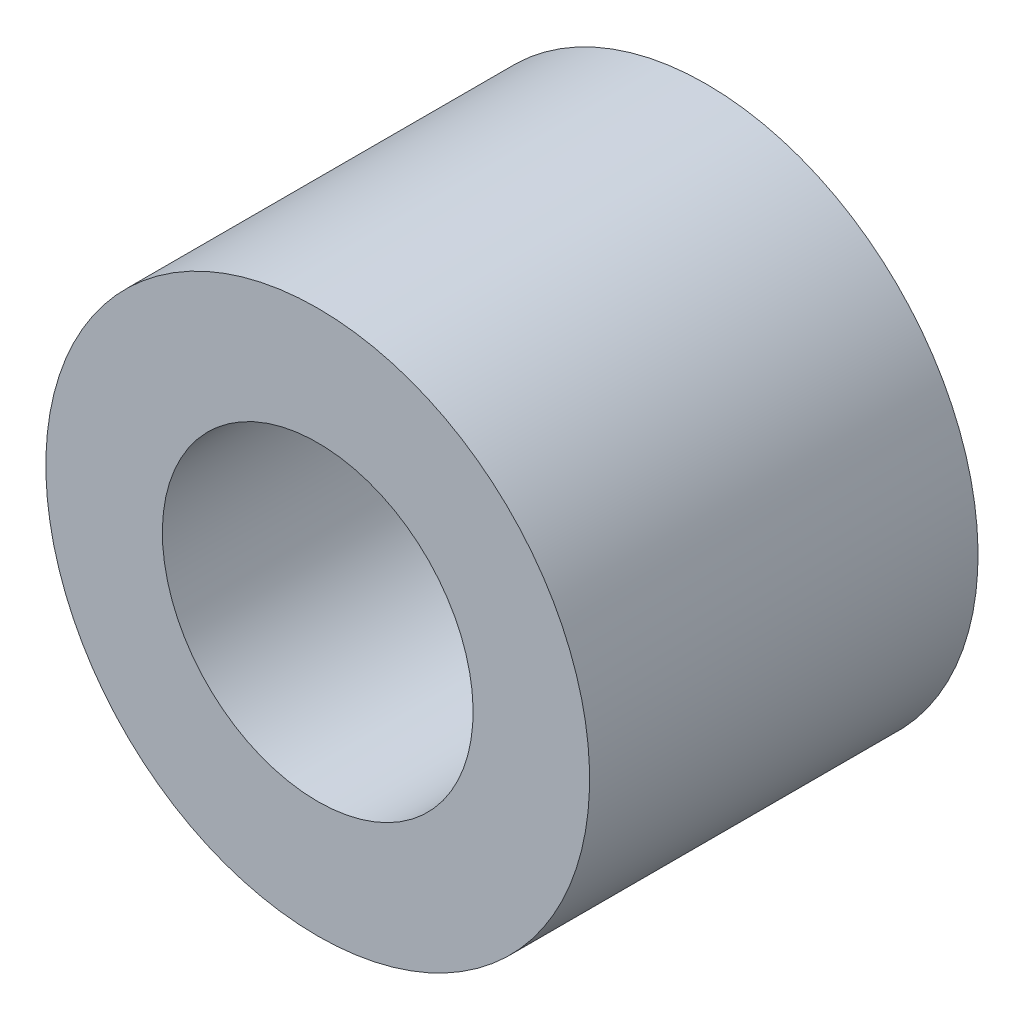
ISO-10303-21;
HEADER;
FILE_DESCRIPTION(('STEP AP214'),'2;1');
FILE_NAME('part.step','',(''),(''),'','','');
FILE_SCHEMA(('AUTOMOTIVE_DESIGN { 1 0 10303 214 1 1 1 1 }'));
ENDSEC;
DATA;
#1=APPLICATION_CONTEXT('core data for automotive mechanical design processes');
#2=APPLICATION_PROTOCOL_DEFINITION('international standard','automotive_design',2000,#1);
#3=PRODUCT_CONTEXT('',#1,'mechanical');
#4=PRODUCT('Part','Part','',(#3));
#5=PRODUCT_RELATED_PRODUCT_CATEGORY('part','',(#4));
#6=PRODUCT_DEFINITION_FORMATION('','',#4);
#7=PRODUCT_DEFINITION_CONTEXT('part definition',#1,'design');
#8=PRODUCT_DEFINITION('design','',#6,#7);
#9=PRODUCT_DEFINITION_SHAPE('','',#8);
#10=(LENGTH_UNIT() NAMED_UNIT(*) SI_UNIT(.MILLI.,.METRE.));
#11=(NAMED_UNIT(*) PLANE_ANGLE_UNIT() SI_UNIT($,.RADIAN.));
#12=(NAMED_UNIT(*) SI_UNIT($,.STERADIAN.) SOLID_ANGLE_UNIT());
#13=UNCERTAINTY_MEASURE_WITH_UNIT(LENGTH_MEASURE(1.E-05),#10,'distance_accuracy_value','');
#14=(GEOMETRIC_REPRESENTATION_CONTEXT(3) GLOBAL_UNCERTAINTY_ASSIGNED_CONTEXT((#13)) GLOBAL_UNIT_ASSIGNED_CONTEXT((#10,
#11,#12)) REPRESENTATION_CONTEXT('',''));
#15=CARTESIAN_POINT('',(0.,0.,0.));
#16=DIRECTION('',(0.,0.,1.));
#17=DIRECTION('',(1.,0.,0.));
#18=AXIS2_PLACEMENT_3D('',#15,#16,#17);
#19=CARTESIAN_POINT('',(17.5,0.,0.));
#20=DIRECTION('',(0.,0.,1.));
#21=DIRECTION('',(0.,-1.,0.));
#22=AXIS2_PLACEMENT_3D('',#19,#20,#21);
#23=PLANE('',#22);
#24=CARTESIAN_POINT('',(0.,0.,0.));
#25=DIRECTION('',(0.,0.,1.));
#26=DIRECTION('',(0.,-1.,0.));
#27=AXIS2_PLACEMENT_3D('',#24,#25,#26);
#28=CIRCLE('',#27,10.);
#29=CARTESIAN_POINT('',(0.,-10.,0.));
#30=VERTEX_POINT('',#29);
#31=EDGE_CURVE('E22',#30,#30,#28,.T.);
#32=ORIENTED_EDGE('',*,*,#31,.T.);
#33=EDGE_LOOP('',(#32));
#34=FACE_BOUND('',#33,.T.);
#35=CARTESIAN_POINT('',(0.,0.,0.));
#36=DIRECTION('',(0.,0.,-1.));
#37=DIRECTION('',(0.,1.,0.));
#38=AXIS2_PLACEMENT_3D('',#35,#36,#37);
#39=CIRCLE('',#38,17.5);
#40=CARTESIAN_POINT('',(0.,17.5,0.));
#41=VERTEX_POINT('',#40);
#42=EDGE_CURVE('E8',#41,#41,#39,.T.);
#43=ORIENTED_EDGE('',*,*,#42,.T.);
#44=EDGE_LOOP('',(#43));
#45=FACE_BOUND('',#44,.T.);
#46=ADVANCED_FACE('F12',(#34,#45),#23,.F.);
#47=CARTESIAN_POINT('',(0.,0.,-20.));
#48=DIRECTION('',(0.,0.,-1.));
#49=DIRECTION('',(0.,1.,0.));
#50=AXIS2_PLACEMENT_3D('',#47,#48,#49);
#51=CYLINDRICAL_SURFACE('',#50,17.5);
#52=ORIENTED_EDGE('',*,*,#42,.F.);
#53=EDGE_LOOP('',(#52));
#54=FACE_BOUND('',#53,.T.);
#55=CARTESIAN_POINT('',(0.,0.,25.));
#56=DIRECTION('',(0.,0.,1.));
#57=DIRECTION('',(0.,-1.,0.));
#58=AXIS2_PLACEMENT_3D('',#55,#56,#57);
#59=CIRCLE('',#58,17.5);
#60=CARTESIAN_POINT('',(0.,-17.5,25.));
#61=VERTEX_POINT('',#60);
#62=EDGE_CURVE('E18',#61,#61,#59,.T.);
#63=ORIENTED_EDGE('',*,*,#62,.F.);
#64=EDGE_LOOP('',(#63));
#65=FACE_BOUND('',#64,.T.);
#66=ADVANCED_FACE('F36',(#54,#65),#51,.T.);
#67=CARTESIAN_POINT('',(0.,0.,25.));
#68=DIRECTION('',(0.,0.,1.));
#69=DIRECTION('',(0.,-1.,0.));
#70=AXIS2_PLACEMENT_3D('',#67,#68,#69);
#71=PLANE('',#70);
#72=CARTESIAN_POINT('',(0.,0.,25.));
#73=DIRECTION('',(0.,0.,1.));
#74=DIRECTION('',(0.,-1.,0.));
#75=AXIS2_PLACEMENT_3D('',#72,#73,#74);
#76=CIRCLE('',#75,10.);
#77=CARTESIAN_POINT('',(0.,-10.,25.));
#78=VERTEX_POINT('',#77);
#79=EDGE_CURVE('E26',#78,#78,#76,.T.);
#80=ORIENTED_EDGE('',*,*,#79,.F.);
#81=EDGE_LOOP('',(#80));
#82=FACE_BOUND('',#81,.T.);
#83=ORIENTED_EDGE('',*,*,#62,.T.);
#84=EDGE_LOOP('',(#83));
#85=FACE_BOUND('',#84,.T.);
#86=ADVANCED_FACE('F34',(#82,#85),#71,.T.);
#87=CARTESIAN_POINT('',(0.,0.,0.));
#88=DIRECTION('',(0.,0.,1.));
#89=DIRECTION('',(0.,-1.,0.));
#90=AXIS2_PLACEMENT_3D('',#87,#88,#89);
#91=CYLINDRICAL_SURFACE('',#90,10.);
#92=ORIENTED_EDGE('',*,*,#31,.F.);
#93=EDGE_LOOP('',(#92));
#94=FACE_BOUND('',#93,.T.);
#95=ORIENTED_EDGE('',*,*,#79,.T.);
#96=EDGE_LOOP('',(#95));
#97=FACE_BOUND('',#96,.T.);
#98=ADVANCED_FACE('F32',(#94,#97),#91,.F.);
#99=CLOSED_SHELL('',(#46,#66,#86,#98));
#100=MANIFOLD_SOLID_BREP('B1',#99);
#101=ADVANCED_BREP_SHAPE_REPRESENTATION('',(#18,#100),#14);
#102=SHAPE_DEFINITION_REPRESENTATION(#9,#101);
ENDSEC;
END-ISO-10303-21;
